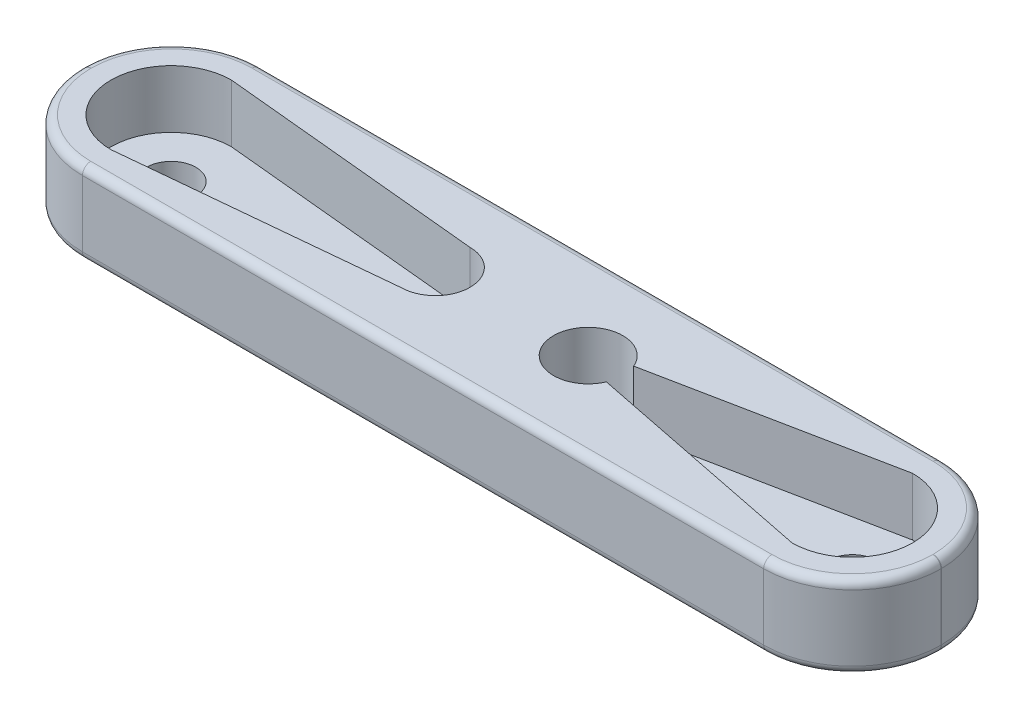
from build123d import *

# Parameters (mm, degrees)
SKETCH1_W           = 52
SKETCH1_H           = 10.77
BOSS_EXTRUDE1_DEPTH = 5
SKETCH2_R           = 1.5
CUT_EXTRUDE1_DEPTH  = 3.5
SKETCH4_R           = 1.5
CUT_EXTRUDE4_DEPTH  = 28.018479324
CUT_EXTRUDE2_DEPTH  = 3.5
CUT_EXTRUDE3_DEPTH  = 28.018479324
FILLET2_R           = 0.5


with BuildPart() as part:
    # Sketch1 → Boss-Extrude1 (new body)
    with BuildSketch(Plane(origin=(0, 0, 0), x_dir=(1, 0, 0), z_dir=(0, 1, 0))):
        Rectangle(SKETCH1_W, SKETCH1_H)
    extrude(amount=BOSS_EXTRUDE1_DEPTH)

    # Sketch2 → Cut-Extrude1 (cut)
    # profile 1 of 2: a face of its own
    with BuildSketch(Plane(origin=(0, 5, 0), x_dir=(1, 0, 0), z_dir=(0, 1, 0))):
        with BuildLine():
            ThreePointArc((-19.929387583, -3.597128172), (-17.812222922, -2.335050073), (-16.98, -0.015))
            ThreePointArc((-16.98, -0.015), (-17.812222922, 2.305050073), (-19.929387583, 3.567128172))
            Line((-19.929387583, 3.567128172), (-20.63, 3.635))
            ThreePointArc((-20.63, 3.635), (-24.28, -0.015), (-20.63, -3.665))
            Line((-20.63, -3.665), (-19.929387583, -3.597128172))
        make_face()
        with Locations(Location((-20.63, -0.015, 0), (0, 0, 270))):
            Circle(SKETCH2_R, mode=Mode.SUBTRACT)
    # profile 2 of 2: a face of its own
    with BuildSketch(Plane(origin=(0, 5, 0), x_dir=(1, 0, 0), z_dir=(0, 1, 0))):
        with BuildLine():
            ThreePointArc((19.222323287, 3.352632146), (17.591865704, 2.00792857), (16.98, -0.015))
            ThreePointArc((16.98, -0.015), (17.591865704, -2.03792857), (19.222323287, -3.382632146))
            Line((19.222323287, -3.382632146), (20.63, -3.665))
            ThreePointArc((20.63, -3.665), (24.28, -0.015), (20.63, 3.635))
            Line((20.63, 3.635), (19.222323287, 3.352632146))
        make_face()
        with Locations(Location((20.63, -0.015, 0), (0, 0, 270))):
            Circle(SKETCH2_R, mode=Mode.SUBTRACT)
    extrude(amount=-CUT_EXTRUDE1_DEPTH, mode=Mode.SUBTRACT)

    # Sketch4 → Cut-Extrude4 (cut, through all)
    with BuildSketch(Plane(origin=(0, 5, 0), x_dir=(1, 0, 0), z_dir=(0, 1, 0))):
        with Locations(Location((-20.63, -0.015, 0), (0, 0, 270))):
            Circle(SKETCH4_R)
        with Locations(Location((20.63, -0.015, 0), (0, 0, 270))):
            Circle(SKETCH4_R)
    extrude(amount=-CUT_EXTRUDE4_DEPTH, mode=Mode.SUBTRACT)

    # Sketch2_3 → Cut-Extrude2 (cut)
    with BuildSketch(Plane(origin=(0, 5, 0), x_dir=(1, 0, 0), z_dir=(0, 1, 0))):
        with BuildLine():
            ThreePointArc((-19.929387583, 3.567128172), (-16.98, -0.015), (-19.929387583, -3.597128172))
            Line((-19.929387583, -3.597128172), (-4.63, -2.115))
            ThreePointArc((-4.63, -2.115), (-2.53, -0.015), (-4.63, 2.085))
            Line((-4.63, 2.085), (-19.929387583, 3.567128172))
        make_face()
        with BuildLine():
            ThreePointArc((19.222323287, -3.382632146), (16.98, -0.015), (19.222323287, 3.352632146))
            Line((19.222323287, 3.352632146), (6.560011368, 0.81268117))
            ThreePointArc((6.560011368, 0.81268117), (2.53, -0.015), (6.560011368, -0.84268117))
            Line((6.560011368, -0.84268117), (19.222323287, -3.382632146))
        make_face()
    extrude(amount=-CUT_EXTRUDE2_DEPTH, mode=Mode.SUBTRACT)

    # Sketch2_4 → Cut-Extrude3 (cut, through all)
    with BuildSketch(Plane(origin=(0, 5, 0), x_dir=(1, 0, 0), z_dir=(0, 1, 0))):
        with BuildLine():
            Line((-26, 5.385), (-26, 0.015))
            ThreePointArc((-26, 0.015), (-24.427163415, 3.812163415), (-20.63, 5.385))
            Line((-20.63, 5.385), (-26, 5.385))
        make_face()
        with BuildLine():
            Line((-26, -5.385), (-20.63, -5.385))
            ThreePointArc((-20.63, -5.385), (-24.427163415, -3.812163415), (-26, -0.015))
            Line((-26, -0.015), (-26, -5.385))
        make_face()
        with BuildLine():
            ThreePointArc((26, -0.015), (24.427163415, -3.812163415), (20.63, -5.385))
            Line((20.63, -5.385), (26, -5.385))
            Line((26, -5.385), (26, -0.015))
        make_face()
        with BuildLine():
            ThreePointArc((20.63, 5.385), (24.427163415, 3.812163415), (26, 0.015))
            Line((26, 0.015), (26, 5.385))
            Line((26, 5.385), (20.63, 5.385))
        make_face()
    extrude(amount=-CUT_EXTRUDE3_DEPTH, mode=Mode.SUBTRACT)

    # Fillet2
    fillet2_edges = [part.edges().sort_by_distance(p)[0] for p in [
        (-24.427163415, 5, 3.812163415),
        (-24.427163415, 0, 3.812163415),
        (-24.427163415, 5, -3.812163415),
        (-24.427163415, 0, -3.812163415),
        (26, 0, 0),
        (0, 0, 5.385),
        (-26, 0, 0),
        (0, 0, -5.385),
        (0, 5, 5.385),
        (-26, 5, 0),
        (0, 5, -5.385),
        (26, 5, 0),
        (24.427163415, 5, -3.812163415),
        (24.427163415, 0, -3.812163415),
        (24.427163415, 0, 3.812163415),
        (24.427163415, 5, 3.812163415),
    ]]
    fillet(fillet2_edges, radius=FILLET2_R)


solid = part.part
